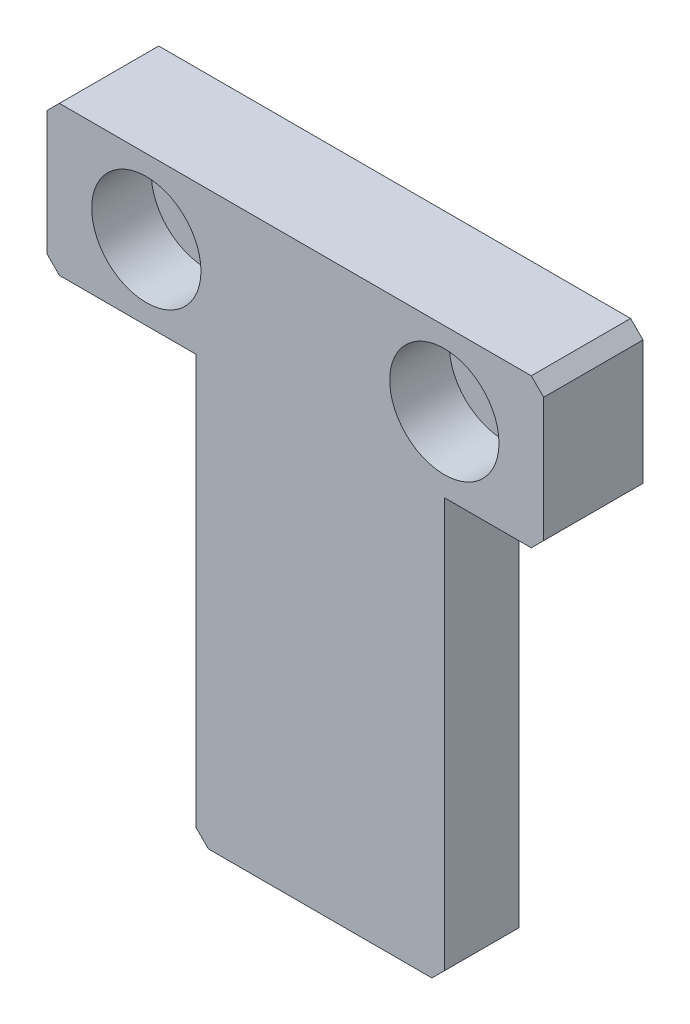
ISO-10303-21;
HEADER;
FILE_DESCRIPTION(('STEP AP214'),'2;1');
FILE_NAME('part.step','',(''),(''),'','','');
FILE_SCHEMA(('AUTOMOTIVE_DESIGN { 1 0 10303 214 1 1 1 1 }'));
ENDSEC;
DATA;
#1=APPLICATION_CONTEXT('core data for automotive mechanical design processes');
#2=APPLICATION_PROTOCOL_DEFINITION('international standard','automotive_design',2000,#1);
#3=PRODUCT_CONTEXT('',#1,'mechanical');
#4=PRODUCT('Part','Part','',(#3));
#5=PRODUCT_RELATED_PRODUCT_CATEGORY('part','',(#4));
#6=PRODUCT_DEFINITION_FORMATION('','',#4);
#7=PRODUCT_DEFINITION_CONTEXT('part definition',#1,'design');
#8=PRODUCT_DEFINITION('design','',#6,#7);
#9=PRODUCT_DEFINITION_SHAPE('','',#8);
#10=(LENGTH_UNIT() NAMED_UNIT(*) SI_UNIT(.MILLI.,.METRE.));
#11=(NAMED_UNIT(*) PLANE_ANGLE_UNIT() SI_UNIT($,.RADIAN.));
#12=(NAMED_UNIT(*) SI_UNIT($,.STERADIAN.) SOLID_ANGLE_UNIT());
#13=UNCERTAINTY_MEASURE_WITH_UNIT(LENGTH_MEASURE(1.E-05),#10,'distance_accuracy_value','');
#14=(GEOMETRIC_REPRESENTATION_CONTEXT(3) GLOBAL_UNCERTAINTY_ASSIGNED_CONTEXT((#13)) GLOBAL_UNIT_ASSIGNED_CONTEXT((#10,
#11,#12)) REPRESENTATION_CONTEXT('',''));
#15=CARTESIAN_POINT('',(0.,0.,0.));
#16=DIRECTION('',(0.,0.,1.));
#17=DIRECTION('',(1.,0.,0.));
#18=AXIS2_PLACEMENT_3D('',#15,#16,#17);
#19=CARTESIAN_POINT('',(6.00000000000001,17.,4.));
#20=DIRECTION('',(1.,0.,0.));
#21=DIRECTION('',(0.,1.,0.));
#22=AXIS2_PLACEMENT_3D('',#19,#20,#21);
#23=PLANE('',#22);
#24=DIRECTION('',(0.,1.,0.));
#25=VECTOR('',#24,1.);
#26=CARTESIAN_POINT('',(6.00000000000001,17.,1.));
#27=LINE('',#26,#25);
#28=CARTESIAN_POINT('',(6.00000000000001,0.5,1.));
#29=VERTEX_POINT('',#28);
#30=CARTESIAN_POINT('',(6.00000000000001,17.,1.));
#31=VERTEX_POINT('',#30);
#32=EDGE_CURVE('E134',#29,#31,#27,.T.);
#33=ORIENTED_EDGE('',*,*,#32,.F.);
#34=DIRECTION('',(0.,0.,1.));
#35=VECTOR('',#34,1.);
#36=CARTESIAN_POINT('',(6.00000000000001,0.5,4.));
#37=LINE('',#36,#35);
#38=CARTESIAN_POINT('',(6.00000000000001,0.5,4.));
#39=VERTEX_POINT('',#38);
#40=EDGE_CURVE('E197',#29,#39,#37,.T.);
#41=ORIENTED_EDGE('',*,*,#40,.T.);
#42=DIRECTION('',(0.,-1.,0.));
#43=VECTOR('',#42,1.);
#44=CARTESIAN_POINT('',(6.00000000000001,17.,4.));
#45=LINE('',#44,#43);
#46=CARTESIAN_POINT('',(6.00000000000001,17.,4.));
#47=VERTEX_POINT('',#46);
#48=EDGE_CURVE('E156',#47,#39,#45,.T.);
#49=ORIENTED_EDGE('',*,*,#48,.F.);
#50=DIRECTION('',(0.,0.,-1.));
#51=VECTOR('',#50,1.);
#52=CARTESIAN_POINT('',(6.00000000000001,17.,4.));
#53=LINE('',#52,#51);
#54=EDGE_CURVE('E149',#47,#31,#53,.T.);
#55=ORIENTED_EDGE('',*,*,#54,.T.);
#56=EDGE_LOOP('',(#33,#41,#49,#55));
#57=FACE_BOUND('',#56,.T.);
#58=ADVANCED_FACE('F34',(#57),#23,.F.);
#59=CARTESIAN_POINT('',(6.00000000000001,0.,4.));
#60=DIRECTION('',(0.,1.,0.));
#61=DIRECTION('',(-1.,0.,0.));
#62=AXIS2_PLACEMENT_3D('',#59,#60,#61);
#63=PLANE('',#62);
#64=DIRECTION('',(-1.,0.,0.));
#65=VECTOR('',#64,1.);
#66=CARTESIAN_POINT('',(20.,0.,0.999999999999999));
#67=LINE('',#66,#65);
#68=CARTESIAN_POINT('',(15.5,0.,0.999999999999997));
#69=VERTEX_POINT('',#68);
#70=CARTESIAN_POINT('',(6.50000000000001,0.,0.999999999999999));
#71=VERTEX_POINT('',#70);
#72=EDGE_CURVE('E49',#69,#71,#67,.T.);
#73=ORIENTED_EDGE('',*,*,#72,.F.);
#74=DIRECTION('',(0.,0.,1.));
#75=VECTOR('',#74,1.);
#76=CARTESIAN_POINT('',(15.5,0.,4.));
#77=LINE('',#76,#75);
#78=CARTESIAN_POINT('',(15.5,0.,4.));
#79=VERTEX_POINT('',#78);
#80=EDGE_CURVE('E176',#69,#79,#77,.T.);
#81=ORIENTED_EDGE('',*,*,#80,.T.);
#82=DIRECTION('',(1.,0.,0.));
#83=VECTOR('',#82,1.);
#84=CARTESIAN_POINT('',(6.00000000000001,0.,4.));
#85=LINE('',#84,#83);
#86=CARTESIAN_POINT('',(6.50000000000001,0.,4.));
#87=VERTEX_POINT('',#86);
#88=EDGE_CURVE('E234',#87,#79,#85,.T.);
#89=ORIENTED_EDGE('',*,*,#88,.F.);
#90=DIRECTION('',(0.,0.,-1.));
#91=VECTOR('',#90,1.);
#92=CARTESIAN_POINT('',(6.50000000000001,0.,4.));
#93=LINE('',#92,#91);
#94=EDGE_CURVE('E173',#87,#71,#93,.T.);
#95=ORIENTED_EDGE('',*,*,#94,.T.);
#96=EDGE_LOOP('',(#73,#81,#89,#95));
#97=FACE_BOUND('',#96,.T.);
#98=ADVANCED_FACE('F281',(#97),#63,.F.);
#99=CARTESIAN_POINT('',(16.,0.,4.));
#100=DIRECTION('',(-1.,0.,0.));
#101=DIRECTION('',(0.,0.,1.));
#102=AXIS2_PLACEMENT_3D('',#99,#100,#101);
#103=PLANE('',#102);
#104=DIRECTION('',(0.,-1.,0.));
#105=VECTOR('',#104,1.);
#106=CARTESIAN_POINT('',(16.,0.,1.));
#107=LINE('',#106,#105);
#108=CARTESIAN_POINT('',(16.,17.,1.));
#109=VERTEX_POINT('',#108);
#110=CARTESIAN_POINT('',(16.,0.500000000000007,1.));
#111=VERTEX_POINT('',#110);
#112=EDGE_CURVE('E310',#109,#111,#107,.T.);
#113=ORIENTED_EDGE('',*,*,#112,.F.);
#114=DIRECTION('',(0.,0.,-1.));
#115=VECTOR('',#114,1.);
#116=CARTESIAN_POINT('',(16.,17.,4.));
#117=LINE('',#116,#115);
#118=CARTESIAN_POINT('',(16.,17.,4.));
#119=VERTEX_POINT('',#118);
#120=EDGE_CURVE('E153',#119,#109,#117,.T.);
#121=ORIENTED_EDGE('',*,*,#120,.F.);
#122=DIRECTION('',(0.,1.,0.));
#123=VECTOR('',#122,1.);
#124=CARTESIAN_POINT('',(16.,0.,4.));
#125=LINE('',#124,#123);
#126=CARTESIAN_POINT('',(16.,0.500000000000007,4.));
#127=VERTEX_POINT('',#126);
#128=EDGE_CURVE('E239',#127,#119,#125,.T.);
#129=ORIENTED_EDGE('',*,*,#128,.F.);
#130=DIRECTION('',(0.,0.,-1.));
#131=VECTOR('',#130,1.);
#132=CARTESIAN_POINT('',(16.,0.500000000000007,4.));
#133=LINE('',#132,#131);
#134=EDGE_CURVE('E157',#127,#111,#133,.T.);
#135=ORIENTED_EDGE('',*,*,#134,.T.);
#136=EDGE_LOOP('',(#113,#121,#129,#135));
#137=FACE_BOUND('',#136,.T.);
#138=ADVANCED_FACE('F286',(#137),#103,.F.);
#139=CARTESIAN_POINT('',(16.,0.500000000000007,4.));
#140=DIRECTION('',(-0.707106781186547,0.707106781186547,0.));
#141=DIRECTION('',(0.,0.,-1.));
#142=AXIS2_PLACEMENT_3D('',#139,#140,#141);
#143=PLANE('',#142);
#144=ORIENTED_EDGE('',*,*,#80,.F.);
#145=DIRECTION('',(-0.707106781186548,-0.707106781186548,0.));
#146=VECTOR('',#145,1.);
#147=CARTESIAN_POINT('',(16.,0.500000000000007,1.));
#148=LINE('',#147,#146);
#149=EDGE_CURVE('E142',#69,#111,#148,.F.);
#150=ORIENTED_EDGE('',*,*,#149,.T.);
#151=ORIENTED_EDGE('',*,*,#134,.F.);
#152=DIRECTION('',(-0.707106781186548,-0.707106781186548,0.));
#153=VECTOR('',#152,1.);
#154=CARTESIAN_POINT('',(7.74999999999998,-7.75,4.));
#155=LINE('',#154,#153);
#156=EDGE_CURVE('E188',#79,#127,#155,.F.);
#157=ORIENTED_EDGE('',*,*,#156,.F.);
#158=EDGE_LOOP('',(#144,#150,#151,#157));
#159=FACE_BOUND('',#158,.T.);
#160=ADVANCED_FACE('F294',(#159),#143,.F.);
#161=CARTESIAN_POINT('',(6.50000000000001,0.,4.));
#162=DIRECTION('',(0.707106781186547,0.707106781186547,0.));
#163=DIRECTION('',(0.,0.,-1.));
#164=AXIS2_PLACEMENT_3D('',#161,#162,#163);
#165=PLANE('',#164);
#166=ORIENTED_EDGE('',*,*,#40,.F.);
#167=DIRECTION('',(-0.707106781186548,0.707106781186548,0.));
#168=VECTOR('',#167,1.);
#169=CARTESIAN_POINT('',(6.50000000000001,0.,0.999999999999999));
#170=LINE('',#169,#168);
#171=EDGE_CURVE('E11',#29,#71,#170,.F.);
#172=ORIENTED_EDGE('',*,*,#171,.T.);
#173=ORIENTED_EDGE('',*,*,#94,.F.);
#174=DIRECTION('',(-0.707106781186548,0.707106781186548,0.));
#175=VECTOR('',#174,1.);
#176=CARTESIAN_POINT('',(3.25000000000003,3.25,4.));
#177=LINE('',#176,#175);
#178=EDGE_CURVE('E184',#39,#87,#177,.F.);
#179=ORIENTED_EDGE('',*,*,#178,.F.);
#180=EDGE_LOOP('',(#166,#172,#173,#179));
#181=FACE_BOUND('',#180,.T.);
#182=ADVANCED_FACE('F293',(#181),#165,.F.);
#183=CARTESIAN_POINT('',(0.,23.,4.));
#184=DIRECTION('',(1.,0.,0.));
#185=DIRECTION('',(0.,1.,0.));
#186=AXIS2_PLACEMENT_3D('',#183,#184,#185);
#187=PLANE('',#186);
#188=DIRECTION('',(0.,-1.,0.));
#189=VECTOR('',#188,1.);
#190=CARTESIAN_POINT('',(0.,23.,0.));
#191=LINE('',#190,#189);
#192=CARTESIAN_POINT('',(0.,22.5,0.));
#193=VERTEX_POINT('',#192);
#194=CARTESIAN_POINT('',(0.,17.5,0.));
#195=VERTEX_POINT('',#194);
#196=EDGE_CURVE('E217',#193,#195,#191,.T.);
#197=ORIENTED_EDGE('',*,*,#196,.T.);
#198=DIRECTION('',(0.,0.,1.));
#199=VECTOR('',#198,1.);
#200=CARTESIAN_POINT('',(0.,17.5,4.));
#201=LINE('',#200,#199);
#202=CARTESIAN_POINT('',(0.,17.5,4.));
#203=VERTEX_POINT('',#202);
#204=EDGE_CURVE('E42',#195,#203,#201,.T.);
#205=ORIENTED_EDGE('',*,*,#204,.T.);
#206=DIRECTION('',(0.,-1.,0.));
#207=VECTOR('',#206,1.);
#208=CARTESIAN_POINT('',(0.,23.,4.));
#209=LINE('',#208,#207);
#210=CARTESIAN_POINT('',(0.,22.5,4.));
#211=VERTEX_POINT('',#210);
#212=EDGE_CURVE('E214',#211,#203,#209,.T.);
#213=ORIENTED_EDGE('',*,*,#212,.F.);
#214=DIRECTION('',(0.,0.,-1.));
#215=VECTOR('',#214,1.);
#216=CARTESIAN_POINT('',(0.,22.5,4.));
#217=LINE('',#216,#215);
#218=EDGE_CURVE('E206',#211,#193,#217,.T.);
#219=ORIENTED_EDGE('',*,*,#218,.T.);
#220=EDGE_LOOP('',(#197,#205,#213,#219));
#221=FACE_BOUND('',#220,.T.);
#222=ADVANCED_FACE('F213',(#221),#187,.F.);
#223=CARTESIAN_POINT('',(16.,17.,4.));
#224=DIRECTION('',(0.,1.,0.));
#225=DIRECTION('',(0.,0.,1.));
#226=AXIS2_PLACEMENT_3D('',#223,#224,#225);
#227=PLANE('',#226);
#228=DIRECTION('',(0.,0.,1.));
#229=VECTOR('',#228,1.);
#230=CARTESIAN_POINT('',(19.5,17.,4.));
#231=LINE('',#230,#229);
#232=CARTESIAN_POINT('',(19.5,17.,0.));
#233=VERTEX_POINT('',#232);
#234=CARTESIAN_POINT('',(19.5,17.,4.));
#235=VERTEX_POINT('',#234);
#236=EDGE_CURVE('E195',#233,#235,#231,.T.);
#237=ORIENTED_EDGE('',*,*,#236,.T.);
#238=DIRECTION('',(1.,0.,0.));
#239=VECTOR('',#238,1.);
#240=CARTESIAN_POINT('',(16.,17.,4.));
#241=LINE('',#240,#239);
#242=EDGE_CURVE('E241',#119,#235,#241,.T.);
#243=ORIENTED_EDGE('',*,*,#242,.F.);
#244=ORIENTED_EDGE('',*,*,#120,.T.);
#245=DIRECTION('',(1.,0.,0.));
#246=VECTOR('',#245,1.);
#247=CARTESIAN_POINT('',(20.,17.,0.999999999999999));
#248=LINE('',#247,#246);
#249=EDGE_CURVE('E137',#31,#109,#248,.T.);
#250=ORIENTED_EDGE('',*,*,#249,.F.);
#251=ORIENTED_EDGE('',*,*,#54,.F.);
#252=DIRECTION('',(1.,0.,0.));
#253=VECTOR('',#252,1.);
#254=CARTESIAN_POINT('',(0.,17.,4.));
#255=LINE('',#254,#253);
#256=CARTESIAN_POINT('',(0.5,17.,4.));
#257=VERTEX_POINT('',#256);
#258=EDGE_CURVE('E225',#257,#47,#255,.T.);
#259=ORIENTED_EDGE('',*,*,#258,.F.);
#260=DIRECTION('',(0.,0.,-1.));
#261=VECTOR('',#260,1.);
#262=CARTESIAN_POINT('',(0.5,17.,4.));
#263=LINE('',#262,#261);
#264=CARTESIAN_POINT('',(0.5,17.,0.));
#265=VERTEX_POINT('',#264);
#266=EDGE_CURVE('E203',#257,#265,#263,.T.);
#267=ORIENTED_EDGE('',*,*,#266,.T.);
#268=DIRECTION('',(1.,0.,0.));
#269=VECTOR('',#268,1.);
#270=CARTESIAN_POINT('',(16.,17.,0.));
#271=LINE('',#270,#269);
#272=EDGE_CURVE('E231',#265,#233,#271,.T.);
#273=ORIENTED_EDGE('',*,*,#272,.T.);
#274=EDGE_LOOP('',(#237,#243,#244,#250,#251,#259,#267,#273));
#275=FACE_BOUND('',#274,.T.);
#276=ADVANCED_FACE('F147',(#275),#227,.F.);
#277=CARTESIAN_POINT('',(20.,23.,4.));
#278=DIRECTION('',(-1.,0.,0.));
#279=DIRECTION('',(0.,0.,1.));
#280=AXIS2_PLACEMENT_3D('',#277,#278,#279);
#281=PLANE('',#280);
#282=DIRECTION('',(0.,1.,0.));
#283=VECTOR('',#282,1.);
#284=CARTESIAN_POINT('',(20.,23.,4.));
#285=LINE('',#284,#283);
#286=CARTESIAN_POINT('',(20.,17.5,4.));
#287=VERTEX_POINT('',#286);
#288=CARTESIAN_POINT('',(20.,22.5,4.));
#289=VERTEX_POINT('',#288);
#290=EDGE_CURVE('E244',#287,#289,#285,.T.);
#291=ORIENTED_EDGE('',*,*,#290,.F.);
#292=DIRECTION('',(0.,0.,-1.));
#293=VECTOR('',#292,1.);
#294=CARTESIAN_POINT('',(20.,17.5,4.));
#295=LINE('',#294,#293);
#296=CARTESIAN_POINT('',(20.,17.5,0.));
#297=VERTEX_POINT('',#296);
#298=EDGE_CURVE('E192',#287,#297,#295,.T.);
#299=ORIENTED_EDGE('',*,*,#298,.T.);
#300=DIRECTION('',(0.,1.,0.));
#301=VECTOR('',#300,1.);
#302=CARTESIAN_POINT('',(20.,23.,0.));
#303=LINE('',#302,#301);
#304=CARTESIAN_POINT('',(20.,22.5,0.));
#305=VERTEX_POINT('',#304);
#306=EDGE_CURVE('E251',#297,#305,#303,.T.);
#307=ORIENTED_EDGE('',*,*,#306,.T.);
#308=DIRECTION('',(0.,0.,1.));
#309=VECTOR('',#308,1.);
#310=CARTESIAN_POINT('',(20.,22.5,4.));
#311=LINE('',#310,#309);
#312=EDGE_CURVE('E190',#305,#289,#311,.T.);
#313=ORIENTED_EDGE('',*,*,#312,.T.);
#314=EDGE_LOOP('',(#291,#299,#307,#313));
#315=FACE_BOUND('',#314,.T.);
#316=ADVANCED_FACE('F266',(#315),#281,.F.);
#317=CARTESIAN_POINT('',(0.,23.,4.));
#318=DIRECTION('',(0.,-1.,0.));
#319=DIRECTION('',(0.,0.,-1.));
#320=AXIS2_PLACEMENT_3D('',#317,#318,#319);
#321=PLANE('',#320);
#322=DIRECTION('',(-1.,0.,0.));
#323=VECTOR('',#322,1.);
#324=CARTESIAN_POINT('',(0.,23.,4.));
#325=LINE('',#324,#323);
#326=CARTESIAN_POINT('',(19.5,23.,4.));
#327=VERTEX_POINT('',#326);
#328=CARTESIAN_POINT('',(0.5,23.,4.));
#329=VERTEX_POINT('',#328);
#330=EDGE_CURVE('E162',#327,#329,#325,.T.);
#331=ORIENTED_EDGE('',*,*,#330,.F.);
#332=DIRECTION('',(0.,0.,-1.));
#333=VECTOR('',#332,1.);
#334=CARTESIAN_POINT('',(19.5,23.,4.));
#335=LINE('',#334,#333);
#336=CARTESIAN_POINT('',(19.5,23.,0.));
#337=VERTEX_POINT('',#336);
#338=EDGE_CURVE('E200',#327,#337,#335,.T.);
#339=ORIENTED_EDGE('',*,*,#338,.T.);
#340=DIRECTION('',(-1.,0.,0.));
#341=VECTOR('',#340,1.);
#342=CARTESIAN_POINT('',(0.,23.,0.));
#343=LINE('',#342,#341);
#344=CARTESIAN_POINT('',(0.5,23.,0.));
#345=VERTEX_POINT('',#344);
#346=EDGE_CURVE('E226',#337,#345,#343,.T.);
#347=ORIENTED_EDGE('',*,*,#346,.T.);
#348=DIRECTION('',(0.,0.,1.));
#349=VECTOR('',#348,1.);
#350=CARTESIAN_POINT('',(0.5,23.,4.));
#351=LINE('',#350,#349);
#352=EDGE_CURVE('E56',#345,#329,#351,.T.);
#353=ORIENTED_EDGE('',*,*,#352,.T.);
#354=EDGE_LOOP('',(#331,#339,#347,#353));
#355=FACE_BOUND('',#354,.T.);
#356=ADVANCED_FACE('F254',(#355),#321,.F.);
#357=CARTESIAN_POINT('',(0.,0.,4.));
#358=DIRECTION('',(0.,0.,1.));
#359=DIRECTION('',(1.,0.,0.));
#360=AXIS2_PLACEMENT_3D('',#357,#358,#359);
#361=PLANE('',#360);
#362=CARTESIAN_POINT('',(4.,20.,4.));
#363=DIRECTION('',(0.,0.,1.));
#364=DIRECTION('',(1.,0.,0.));
#365=AXIS2_PLACEMENT_3D('',#362,#363,#364);
#366=CIRCLE('',#365,2.2);
#367=CARTESIAN_POINT('',(6.2,20.,4.));
#368=VERTEX_POINT('',#367);
#369=EDGE_CURVE('E311',#368,#368,#366,.T.);
#370=ORIENTED_EDGE('',*,*,#369,.F.);
#371=EDGE_LOOP('',(#370));
#372=FACE_BOUND('',#371,.T.);
#373=CARTESIAN_POINT('',(16.,20.,4.));
#374=DIRECTION('',(0.,0.,1.));
#375=DIRECTION('',(1.,0.,0.));
#376=AXIS2_PLACEMENT_3D('',#373,#374,#375);
#377=CIRCLE('',#376,2.2);
#378=CARTESIAN_POINT('',(18.2,20.,4.));
#379=VERTEX_POINT('',#378);
#380=EDGE_CURVE('E326',#379,#379,#377,.T.);
#381=ORIENTED_EDGE('',*,*,#380,.F.);
#382=EDGE_LOOP('',(#381));
#383=FACE_BOUND('',#382,.T.);
#384=ORIENTED_EDGE('',*,*,#88,.T.);
#385=ORIENTED_EDGE('',*,*,#156,.T.);
#386=ORIENTED_EDGE('',*,*,#128,.T.);
#387=ORIENTED_EDGE('',*,*,#242,.T.);
#388=DIRECTION('',(-0.707106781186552,-0.707106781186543,0.));
#389=VECTOR('',#388,1.);
#390=CARTESIAN_POINT('',(1.24999999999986,-1.24999999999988,4.));
#391=LINE('',#390,#389);
#392=EDGE_CURVE('E186',#235,#287,#391,.F.);
#393=ORIENTED_EDGE('',*,*,#392,.T.);
#394=ORIENTED_EDGE('',*,*,#290,.T.);
#395=DIRECTION('',(0.707106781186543,-0.707106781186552,0.));
#396=VECTOR('',#395,1.);
#397=CARTESIAN_POINT('',(21.2500000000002,21.2499999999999,4.));
#398=LINE('',#397,#396);
#399=EDGE_CURVE('E182',#289,#327,#398,.F.);
#400=ORIENTED_EDGE('',*,*,#399,.T.);
#401=ORIENTED_EDGE('',*,*,#330,.T.);
#402=DIRECTION('',(0.707106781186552,0.707106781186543,0.));
#403=VECTOR('',#402,1.);
#404=CARTESIAN_POINT('',(-11.25,11.2500000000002,4.));
#405=LINE('',#404,#403);
#406=EDGE_CURVE('E178',#329,#211,#405,.F.);
#407=ORIENTED_EDGE('',*,*,#406,.T.);
#408=ORIENTED_EDGE('',*,*,#212,.T.);
#409=DIRECTION('',(-0.707106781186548,0.707106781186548,0.));
#410=VECTOR('',#409,1.);
#411=CARTESIAN_POINT('',(8.74999999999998,8.75000000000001,4.));
#412=LINE('',#411,#410);
#413=EDGE_CURVE('E180',#203,#257,#412,.F.);
#414=ORIENTED_EDGE('',*,*,#413,.T.);
#415=ORIENTED_EDGE('',*,*,#258,.T.);
#416=ORIENTED_EDGE('',*,*,#48,.T.);
#417=ORIENTED_EDGE('',*,*,#178,.T.);
#418=EDGE_LOOP('',(#384,#385,#386,#387,#393,#394,#400,#401,#407,#408,#414,#415,#416,#417));
#419=FACE_BOUND('',#418,.T.);
#420=ADVANCED_FACE('F223',(#372,#383,#419),#361,.T.);
#421=CARTESIAN_POINT('',(0.,0.,0.));
#422=DIRECTION('',(0.,0.,1.));
#423=DIRECTION('',(1.,0.,0.));
#424=AXIS2_PLACEMENT_3D('',#421,#422,#423);
#425=PLANE('',#424);
#426=CARTESIAN_POINT('',(4.,20.,0.));
#427=DIRECTION('',(0.,0.,1.));
#428=DIRECTION('',(1.,0.,0.));
#429=AXIS2_PLACEMENT_3D('',#426,#427,#428);
#430=CIRCLE('',#429,1.2);
#431=CARTESIAN_POINT('',(5.2,20.,0.));
#432=VERTEX_POINT('',#431);
#433=EDGE_CURVE('E323',#432,#432,#430,.T.);
#434=ORIENTED_EDGE('',*,*,#433,.T.);
#435=EDGE_LOOP('',(#434));
#436=FACE_BOUND('',#435,.T.);
#437=CARTESIAN_POINT('',(16.,20.,0.));
#438=DIRECTION('',(0.,0.,1.));
#439=DIRECTION('',(1.,0.,0.));
#440=AXIS2_PLACEMENT_3D('',#437,#438,#439);
#441=CIRCLE('',#440,1.2);
#442=CARTESIAN_POINT('',(17.2,20.,0.));
#443=VERTEX_POINT('',#442);
#444=EDGE_CURVE('E249',#443,#443,#441,.T.);
#445=ORIENTED_EDGE('',*,*,#444,.T.);
#446=EDGE_LOOP('',(#445));
#447=FACE_BOUND('',#446,.T.);
#448=ORIENTED_EDGE('',*,*,#272,.F.);
#449=DIRECTION('',(0.707106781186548,-0.707106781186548,0.));
#450=VECTOR('',#449,1.);
#451=CARTESIAN_POINT('',(0.5,17.,0.));
#452=LINE('',#451,#450);
#453=EDGE_CURVE('E167',#265,#195,#452,.F.);
#454=ORIENTED_EDGE('',*,*,#453,.T.);
#455=ORIENTED_EDGE('',*,*,#196,.F.);
#456=DIRECTION('',(-0.707106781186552,-0.707106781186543,0.));
#457=VECTOR('',#456,1.);
#458=CARTESIAN_POINT('',(0.,22.5,0.));
#459=LINE('',#458,#457);
#460=EDGE_CURVE('E160',#193,#345,#459,.F.);
#461=ORIENTED_EDGE('',*,*,#460,.T.);
#462=ORIENTED_EDGE('',*,*,#346,.F.);
#463=DIRECTION('',(-0.707106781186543,0.707106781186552,0.));
#464=VECTOR('',#463,1.);
#465=CARTESIAN_POINT('',(19.5,23.,0.));
#466=LINE('',#465,#464);
#467=EDGE_CURVE('E169',#337,#305,#466,.F.);
#468=ORIENTED_EDGE('',*,*,#467,.T.);
#469=ORIENTED_EDGE('',*,*,#306,.F.);
#470=DIRECTION('',(0.707106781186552,0.707106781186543,0.));
#471=VECTOR('',#470,1.);
#472=CARTESIAN_POINT('',(20.,17.5,0.));
#473=LINE('',#472,#471);
#474=EDGE_CURVE('E171',#297,#233,#473,.F.);
#475=ORIENTED_EDGE('',*,*,#474,.T.);
#476=EDGE_LOOP('',(#448,#454,#455,#461,#462,#468,#469,#475));
#477=FACE_BOUND('',#476,.T.);
#478=ADVANCED_FACE('F258',(#436,#447,#477),#425,.F.);
#479=CARTESIAN_POINT('',(16.,20.,4.));
#480=DIRECTION('',(0.,0.,1.));
#481=DIRECTION('',(1.,0.,0.));
#482=AXIS2_PLACEMENT_3D('',#479,#480,#481);
#483=CYLINDRICAL_SURFACE('',#482,1.2);
#484=ORIENTED_EDGE('',*,*,#444,.F.);
#485=EDGE_LOOP('',(#484));
#486=FACE_BOUND('',#485,.T.);
#487=CARTESIAN_POINT('',(16.,20.,1.6));
#488=DIRECTION('',(0.,0.,1.));
#489=DIRECTION('',(1.,0.,0.));
#490=AXIS2_PLACEMENT_3D('',#487,#488,#489);
#491=CIRCLE('',#490,1.2);
#492=CARTESIAN_POINT('',(17.2,20.,1.6));
#493=VERTEX_POINT('',#492);
#494=EDGE_CURVE('E332',#493,#493,#491,.T.);
#495=ORIENTED_EDGE('',*,*,#494,.T.);
#496=EDGE_LOOP('',(#495));
#497=FACE_BOUND('',#496,.T.);
#498=ADVANCED_FACE('F338',(#486,#497),#483,.F.);
#499=CARTESIAN_POINT('',(17.2,20.,1.6));
#500=DIRECTION('',(0.,0.,-1.));
#501=DIRECTION('',(-1.,0.,0.));
#502=AXIS2_PLACEMENT_3D('',#499,#500,#501);
#503=PLANE('',#502);
#504=ORIENTED_EDGE('',*,*,#494,.F.);
#505=EDGE_LOOP('',(#504));
#506=FACE_BOUND('',#505,.T.);
#507=CARTESIAN_POINT('',(16.,20.,1.6));
#508=DIRECTION('',(0.,0.,1.));
#509=DIRECTION('',(1.,0.,0.));
#510=AXIS2_PLACEMENT_3D('',#507,#508,#509);
#511=CIRCLE('',#510,2.2);
#512=CARTESIAN_POINT('',(18.2,20.,1.6));
#513=VERTEX_POINT('',#512);
#514=EDGE_CURVE('E329',#513,#513,#511,.T.);
#515=ORIENTED_EDGE('',*,*,#514,.T.);
#516=EDGE_LOOP('',(#515));
#517=FACE_BOUND('',#516,.T.);
#518=ADVANCED_FACE('F341',(#506,#517),#503,.F.);
#519=CARTESIAN_POINT('',(16.,20.,4.));
#520=DIRECTION('',(0.,0.,1.));
#521=DIRECTION('',(1.,0.,0.));
#522=AXIS2_PLACEMENT_3D('',#519,#520,#521);
#523=CYLINDRICAL_SURFACE('',#522,2.2);
#524=ORIENTED_EDGE('',*,*,#514,.F.);
#525=EDGE_LOOP('',(#524));
#526=FACE_BOUND('',#525,.T.);
#527=ORIENTED_EDGE('',*,*,#380,.T.);
#528=EDGE_LOOP('',(#527));
#529=FACE_BOUND('',#528,.T.);
#530=ADVANCED_FACE('F347',(#526,#529),#523,.F.);
#531=CARTESIAN_POINT('',(4.,20.,4.));
#532=DIRECTION('',(0.,0.,1.));
#533=DIRECTION('',(1.,0.,0.));
#534=AXIS2_PLACEMENT_3D('',#531,#532,#533);
#535=CYLINDRICAL_SURFACE('',#534,1.2);
#536=ORIENTED_EDGE('',*,*,#433,.F.);
#537=EDGE_LOOP('',(#536));
#538=FACE_BOUND('',#537,.T.);
#539=CARTESIAN_POINT('',(4.,20.,1.6));
#540=DIRECTION('',(0.,0.,1.));
#541=DIRECTION('',(1.,0.,0.));
#542=AXIS2_PLACEMENT_3D('',#539,#540,#541);
#543=CIRCLE('',#542,1.2);
#544=CARTESIAN_POINT('',(5.2,20.,1.6));
#545=VERTEX_POINT('',#544);
#546=EDGE_CURVE('E320',#545,#545,#543,.T.);
#547=ORIENTED_EDGE('',*,*,#546,.T.);
#548=EDGE_LOOP('',(#547));
#549=FACE_BOUND('',#548,.T.);
#550=ADVANCED_FACE('F353',(#538,#549),#535,.F.);
#551=CARTESIAN_POINT('',(5.19999999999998,20.,1.6));
#552=DIRECTION('',(0.,0.,-1.));
#553=DIRECTION('',(-1.,0.,0.));
#554=AXIS2_PLACEMENT_3D('',#551,#552,#553);
#555=PLANE('',#554);
#556=ORIENTED_EDGE('',*,*,#546,.F.);
#557=EDGE_LOOP('',(#556));
#558=FACE_BOUND('',#557,.T.);
#559=CARTESIAN_POINT('',(4.,20.,1.6));
#560=DIRECTION('',(0.,0.,1.));
#561=DIRECTION('',(1.,0.,0.));
#562=AXIS2_PLACEMENT_3D('',#559,#560,#561);
#563=CIRCLE('',#562,2.2);
#564=CARTESIAN_POINT('',(6.2,20.,1.6));
#565=VERTEX_POINT('',#564);
#566=EDGE_CURVE('E314',#565,#565,#563,.T.);
#567=ORIENTED_EDGE('',*,*,#566,.T.);
#568=EDGE_LOOP('',(#567));
#569=FACE_BOUND('',#568,.T.);
#570=ADVANCED_FACE('F406',(#558,#569),#555,.F.);
#571=CARTESIAN_POINT('',(4.,20.,4.));
#572=DIRECTION('',(0.,0.,1.));
#573=DIRECTION('',(1.,0.,0.));
#574=AXIS2_PLACEMENT_3D('',#571,#572,#573);
#575=CYLINDRICAL_SURFACE('',#574,2.2);
#576=ORIENTED_EDGE('',*,*,#566,.F.);
#577=EDGE_LOOP('',(#576));
#578=FACE_BOUND('',#577,.T.);
#579=ORIENTED_EDGE('',*,*,#369,.T.);
#580=EDGE_LOOP('',(#579));
#581=FACE_BOUND('',#580,.T.);
#582=ADVANCED_FACE('F277',(#578,#581),#575,.F.);
#583=CARTESIAN_POINT('',(20.,17.5,4.));
#584=DIRECTION('',(-0.707106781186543,0.707106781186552,0.));
#585=DIRECTION('',(0.,0.,-1.));
#586=AXIS2_PLACEMENT_3D('',#583,#584,#585);
#587=PLANE('',#586);
#588=ORIENTED_EDGE('',*,*,#392,.F.);
#589=ORIENTED_EDGE('',*,*,#236,.F.);
#590=ORIENTED_EDGE('',*,*,#474,.F.);
#591=ORIENTED_EDGE('',*,*,#298,.F.);
#592=EDGE_LOOP('',(#588,#589,#590,#591));
#593=FACE_BOUND('',#592,.T.);
#594=ADVANCED_FACE('F263',(#593),#587,.F.);
#595=CARTESIAN_POINT('',(19.5,23.,4.));
#596=DIRECTION('',(-0.707106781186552,-0.707106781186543,0.));
#597=DIRECTION('',(0.,0.,-1.));
#598=AXIS2_PLACEMENT_3D('',#595,#596,#597);
#599=PLANE('',#598);
#600=ORIENTED_EDGE('',*,*,#399,.F.);
#601=ORIENTED_EDGE('',*,*,#312,.F.);
#602=ORIENTED_EDGE('',*,*,#467,.F.);
#603=ORIENTED_EDGE('',*,*,#338,.F.);
#604=EDGE_LOOP('',(#600,#601,#602,#603));
#605=FACE_BOUND('',#604,.T.);
#606=ADVANCED_FACE('F270',(#605),#599,.F.);
#607=CARTESIAN_POINT('',(0.5,17.,4.));
#608=DIRECTION('',(0.707106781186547,0.707106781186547,0.));
#609=DIRECTION('',(0.,0.,-1.));
#610=AXIS2_PLACEMENT_3D('',#607,#608,#609);
#611=PLANE('',#610);
#612=ORIENTED_EDGE('',*,*,#413,.F.);
#613=ORIENTED_EDGE('',*,*,#204,.F.);
#614=ORIENTED_EDGE('',*,*,#453,.F.);
#615=ORIENTED_EDGE('',*,*,#266,.F.);
#616=EDGE_LOOP('',(#612,#613,#614,#615));
#617=FACE_BOUND('',#616,.T.);
#618=ADVANCED_FACE('F229',(#617),#611,.F.);
#619=CARTESIAN_POINT('',(0.,22.5,4.));
#620=DIRECTION('',(0.707106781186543,-0.707106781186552,0.));
#621=DIRECTION('',(0.,0.,-1.));
#622=AXIS2_PLACEMENT_3D('',#619,#620,#621);
#623=PLANE('',#622);
#624=ORIENTED_EDGE('',*,*,#406,.F.);
#625=ORIENTED_EDGE('',*,*,#352,.F.);
#626=ORIENTED_EDGE('',*,*,#460,.F.);
#627=ORIENTED_EDGE('',*,*,#218,.F.);
#628=EDGE_LOOP('',(#624,#625,#626,#627));
#629=FACE_BOUND('',#628,.T.);
#630=ADVANCED_FACE('F36',(#629),#623,.F.);
#631=CARTESIAN_POINT('',(0.,0.,0.999999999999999));
#632=DIRECTION('',(0.,0.,-1.));
#633=DIRECTION('',(-1.,0.,0.));
#634=AXIS2_PLACEMENT_3D('',#631,#632,#633);
#635=PLANE('',#634);
#636=ORIENTED_EDGE('',*,*,#112,.T.);
#637=ORIENTED_EDGE('',*,*,#149,.F.);
#638=ORIENTED_EDGE('',*,*,#72,.T.);
#639=ORIENTED_EDGE('',*,*,#171,.F.);
#640=ORIENTED_EDGE('',*,*,#32,.T.);
#641=ORIENTED_EDGE('',*,*,#249,.T.);
#642=EDGE_LOOP('',(#636,#637,#638,#639,#640,#641));
#643=FACE_BOUND('',#642,.T.);
#644=ADVANCED_FACE('F136',(#643),#635,.T.);
#645=CLOSED_SHELL('',(#58,#98,#138,#160,#182,#222,#276,#316,#356,#420,#478,#498,#518,#530,#550,
#570,#582,#594,#606,#618,#630,#644));
#646=MANIFOLD_SOLID_BREP('B2',#645);
#647=ADVANCED_BREP_SHAPE_REPRESENTATION('',(#18,#646),#14);
#648=SHAPE_DEFINITION_REPRESENTATION(#9,#647);
ENDSEC;
END-ISO-10303-21;
